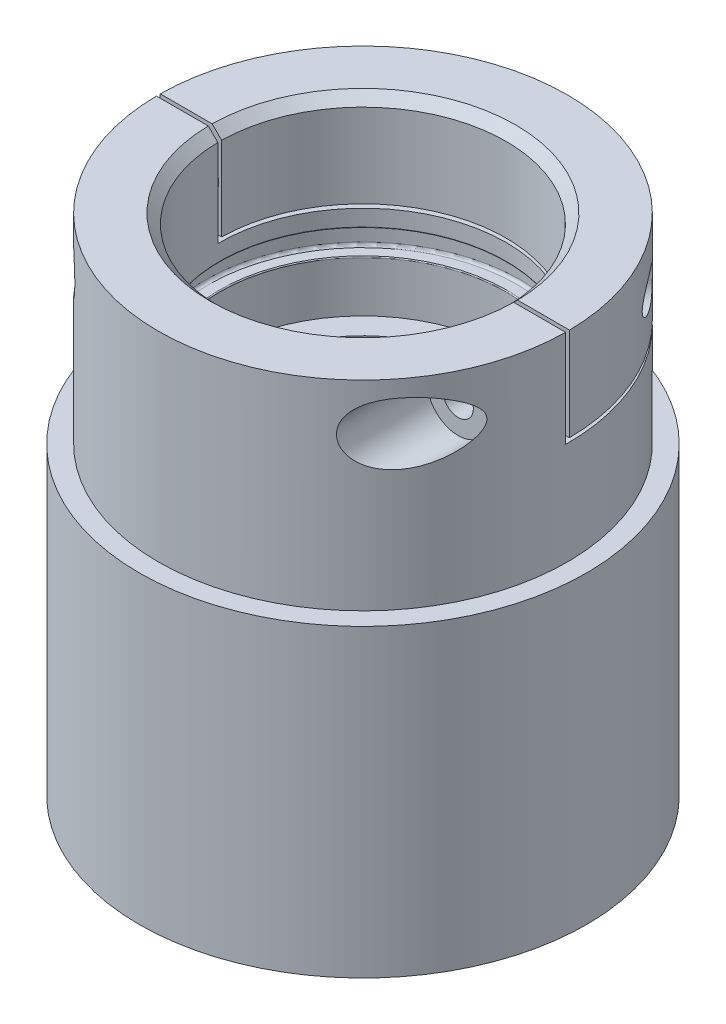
from build123d import *

# Parameters (mm, degrees)
R_P_TITION_CIRCULAIRE1_COUNT         = 3
ESQUISSE4_R                          = 0.89
ESQUISSE6_W                          = 1.65
ESQUISSE6_H                          = 23.5
ENL_V_DE_MAT_EXTRU_MINCE1_DEPTH      = 63.557973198
ENL_V_DE_MAT_EXTRU_MINCE1_DEPTH_BACK = 63.557973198
CONG_1_R                             = 0.3
CONG_2_R                             = 0.1
CHANFREIN1_SIZE                      = 1
CHANFREIN2_SIZE                      = 1


with BuildPart() as part:
    # Esquisse1 → R_volution1 (revolve)
    with BuildSketch(Plane.XY, mode=Mode.PRIVATE) as r_volution1_sk:
        Polygon((15.05, 53), (15.05, 41), (16.5, 41), (16.5, 38.4), (15.05, 38.4), (15.05, 33), (12.5, 33), (12.5, 30), (19.3, 30), (19.3, 2.747477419), (20.3, 0), (23.5, 0), (23.5, 32), (21.5, 32), (21.5, 53), align=None)
    revolve(r_volution1_sk.sketch.rotate(Axis((0, 48.81914096, 0), (0, -1, 0)), 90), axis=Axis((0, 48.81914096, 0), (0, -1, 0)))

    # Esquisse2 → Trou taraud_ M21 (revolve, cut)
    with BuildSketch(Plane(origin=(0, 0, -21.5), x_dir=(0, 0, -1), z_dir=(1, 0, 0))):
        Polygon((0, 0), (0, 7.980688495), (0.8, 7.5), (0.8, 0), align=None)
    trou_taraud_m21 = revolve(axis=Axis((0, -6.35, -21.5), (0, 1, 0)), mode=Mode.SUBTRACT)

    # R_p_tition circulaire1: Trou taraud_ M21 ×3 about axis
    r_p_tition_circulaire1_axis = Axis((0, 0, 0), (0, 1, 0))
    for i in range(1, R_P_TITION_CIRCULAIRE1_COUNT):
        add(trou_taraud_m21.rotate(r_p_tition_circulaire1_axis, i * 360 / R_P_TITION_CIRCULAIRE1_COUNT), mode=Mode.SUBTRACT)

    # Esquisse5 → Enl_vement de mati_re-R_volution1 (revolve, cut)
    with BuildSketch(Plane(origin=(0, 48, 0), x_dir=(1, 0, 0), z_dir=(0, 1, 0)), mode=Mode.PRIVATE) as enl_vement_de_mati_re_r_volution1_sk:
        Polygon((-17, -27), (-17, 0), (-15.4, 0), (-15.4, -7), (-13.75, -7), (-13.75, -27), align=None)
    enl_vement_de_mati_re_r_volution1 = revolve(enl_vement_de_mati_re_r_volution1_sk.sketch.rotate(Axis((-17, 48, -22.436241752), (0, 0, 1)), 180), axis=Axis((-17, 48, -22.436241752), (0, 0, 1)), mode=Mode.SUBTRACT)

    # Esquisse6 → Trou taraud_ M41 (revolve, cut)
    with BuildSketch(Plane(origin=(-17, 48, 0), x_dir=(0, -1, 0), z_dir=(1, 0, 0))):
        with Locations((0.825, 11.75)):
            Rectangle(ESQUISSE6_W, ESQUISSE6_H)
    trou_taraud_m41 = revolve(axis=Axis((-17, 48, 6.35), (0, 0, -1)), mode=Mode.SUBTRACT)

    # Sym_trie1: Enl_vement de mati_re-R_volution1, Trou taraud_ M41 across plane
    add(enl_vement_de_mati_re_r_volution1.mirror(Plane(origin=(0, 0, 0), x_dir=(0, 0, 1), z_dir=(1, 0, 0))), mode=Mode.SUBTRACT)
    add(trou_taraud_m41.mirror(Plane(origin=(0, 0, 0), x_dir=(0, 0, 1), z_dir=(1, 0, 0))), mode=Mode.SUBTRACT)

    # Esquisse8 → Enl_v. de mat.-Extru.-Mince1 (cut, two sides: drawn at the far end of the back side and taken through both)
    with BuildSketch(Plane(origin=(0, 0, 0), x_dir=(0, 0, -1), z_dir=(1, 0, 0)).offset(-ENL_V_DE_MAT_EXTRU_MINCE1_DEPTH_BACK)):
        Polygon((-0.2, 53), (-0.2, 42.8), (40, 42.8), (40, 43.2), (0.2, 43.2), (0.2, 53), align=None)
    extrude(amount=ENL_V_DE_MAT_EXTRU_MINCE1_DEPTH + ENL_V_DE_MAT_EXTRU_MINCE1_DEPTH_BACK, mode=Mode.SUBTRACT)


with BuildPart() as body_2:
    # Esquisse4 → R_volution2 (revolve)
    with BuildSketch(Plane.XY, mode=Mode.PRIVATE) as r_volution2_sk:
        with Locations((15.825, 39.29)):
            Circle(ESQUISSE4_R)
    revolve(r_volution2_sk.sketch.rotate(Axis((0, 48.81914096, 0), (0, -1, 0)), 90), axis=Axis((0, 48.81914096, 0), (0, -1, 0)))


with BuildPart() as enl_v_de_mat_extru_mince1_piece_1:
    # of the separate pieces the step leaves, piece 1, a body of its own (enl_v_de_mat_extru_mince1_pieces)
    add(part.part.solids().sort_by_distance((0, 53, 15.05))[0])

    # Cong_1
    cong_1_edges = [enl_v_de_mat_extru_mince1_piece_1.edges().sort_by_distance(p)[0] for p in [
        (0, 41, -16.5),
        (0, 38.4, -16.5),
    ]]
    fillet(cong_1_edges, radius=CONG_1_R)

    # Cong_2
    cong_2_edges = [enl_v_de_mat_extru_mince1_piece_1.edges().sort_by_distance(p)[0] for p in [
        (0, 41, -15.05),
        (0, 38.4, -15.05),
    ]]
    fillet(cong_2_edges, radius=CONG_2_R)

    # Chanfrein1
    chanfrein1_edges = [enl_v_de_mat_extru_mince1_piece_1.edges().sort_by_distance(p)[0] for p in [
        (-10.571009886, 53, 10.712434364),
    ]]
    chamfer(chanfrein1_edges, length=CHANFREIN1_SIZE)


with BuildPart() as enl_v_de_mat_extru_mince1_piece_2:
    # of the separate pieces the step leaves, piece 2, a body of its own (enl_v_de_mat_extru_mince1_pieces)
    add(part.part.solids().sort_by_distance((-15.048671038, 53, -0.2))[0])

    # Chanfrein2
    chanfrein2_edges = [enl_v_de_mat_extru_mince1_piece_2.edges().sort_by_distance(p)[0] for p in [
        (0, 53, -15.05),
    ]]
    chamfer(chanfrein2_edges, length=CHANFREIN2_SIZE)


solid = Compound([enl_v_de_mat_extru_mince1_piece_1.part, enl_v_de_mat_extru_mince1_piece_2.part])
